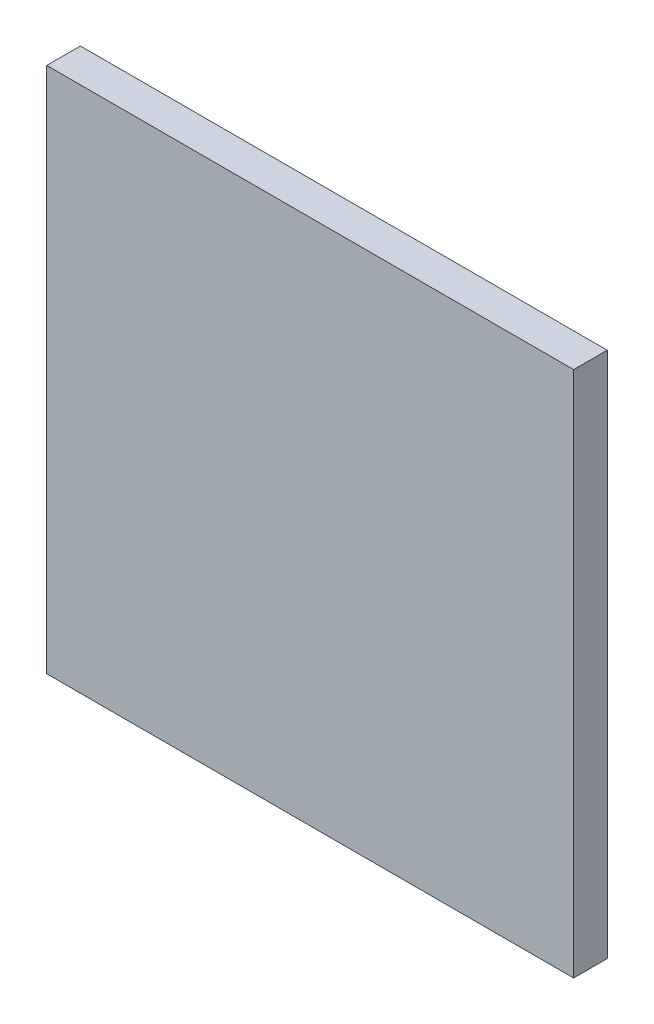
ISO-10303-21;
HEADER;
FILE_DESCRIPTION(('STEP AP214'),'2;1');
FILE_NAME('part.step','',(''),(''),'','','');
FILE_SCHEMA(('AUTOMOTIVE_DESIGN { 1 0 10303 214 1 1 1 1 }'));
ENDSEC;
DATA;
#1=APPLICATION_CONTEXT('core data for automotive mechanical design processes');
#2=APPLICATION_PROTOCOL_DEFINITION('international standard','automotive_design',2000,#1);
#3=PRODUCT_CONTEXT('',#1,'mechanical');
#4=PRODUCT('Part','Part','',(#3));
#5=PRODUCT_RELATED_PRODUCT_CATEGORY('part','',(#4));
#6=PRODUCT_DEFINITION_FORMATION('','',#4);
#7=PRODUCT_DEFINITION_CONTEXT('part definition',#1,'design');
#8=PRODUCT_DEFINITION('design','',#6,#7);
#9=PRODUCT_DEFINITION_SHAPE('','',#8);
#10=(LENGTH_UNIT() NAMED_UNIT(*) SI_UNIT(.MILLI.,.METRE.));
#11=(NAMED_UNIT(*) PLANE_ANGLE_UNIT() SI_UNIT($,.RADIAN.));
#12=(NAMED_UNIT(*) SI_UNIT($,.STERADIAN.) SOLID_ANGLE_UNIT());
#13=UNCERTAINTY_MEASURE_WITH_UNIT(LENGTH_MEASURE(1.E-05),#10,'distance_accuracy_value','');
#14=(GEOMETRIC_REPRESENTATION_CONTEXT(3) GLOBAL_UNCERTAINTY_ASSIGNED_CONTEXT((#13)) GLOBAL_UNIT_ASSIGNED_CONTEXT((#10,
#11,#12)) REPRESENTATION_CONTEXT('',''));
#15=CARTESIAN_POINT('',(0.,0.,0.));
#16=DIRECTION('',(0.,0.,1.));
#17=DIRECTION('',(1.,0.,0.));
#18=AXIS2_PLACEMENT_3D('',#15,#16,#17);
#19=CARTESIAN_POINT('',(23.5,23.5,3.));
#20=DIRECTION('',(-1.,0.,0.));
#21=DIRECTION('',(0.,-1.,0.));
#22=AXIS2_PLACEMENT_3D('',#19,#20,#21);
#23=PLANE('',#22);
#24=DIRECTION('',(0.,1.,0.));
#25=VECTOR('',#24,1.);
#26=CARTESIAN_POINT('',(23.5,23.5,0.));
#27=LINE('',#26,#25);
#28=CARTESIAN_POINT('',(23.5,-23.5,0.));
#29=VERTEX_POINT('',#28);
#30=CARTESIAN_POINT('',(23.5,23.5,0.));
#31=VERTEX_POINT('',#30);
#32=EDGE_CURVE('E96',#29,#31,#27,.T.);
#33=ORIENTED_EDGE('',*,*,#32,.T.);
#34=DIRECTION('',(0.,0.,-1.));
#35=VECTOR('',#34,1.);
#36=CARTESIAN_POINT('',(23.5,23.5,3.));
#37=LINE('',#36,#35);
#38=CARTESIAN_POINT('',(23.5,23.5,3.));
#39=VERTEX_POINT('',#38);
#40=EDGE_CURVE('E11',#39,#31,#37,.T.);
#41=ORIENTED_EDGE('',*,*,#40,.F.);
#42=DIRECTION('',(0.,1.,0.));
#43=VECTOR('',#42,1.);
#44=CARTESIAN_POINT('',(23.5,23.5,3.));
#45=LINE('',#44,#43);
#46=CARTESIAN_POINT('',(23.5,-23.5,3.));
#47=VERTEX_POINT('',#46);
#48=EDGE_CURVE('E84',#47,#39,#45,.T.);
#49=ORIENTED_EDGE('',*,*,#48,.F.);
#50=DIRECTION('',(0.,0.,-1.));
#51=VECTOR('',#50,1.);
#52=CARTESIAN_POINT('',(23.5,-23.5,3.));
#53=LINE('',#52,#51);
#54=EDGE_CURVE('E92',#47,#29,#53,.T.);
#55=ORIENTED_EDGE('',*,*,#54,.T.);
#56=EDGE_LOOP('',(#33,#41,#49,#55));
#57=FACE_BOUND('',#56,.T.);
#58=ADVANCED_FACE('F33',(#57),#23,.F.);
#59=CARTESIAN_POINT('',(-23.5,23.5,3.));
#60=DIRECTION('',(0.,-1.,0.));
#61=DIRECTION('',(0.,0.,-1.));
#62=AXIS2_PLACEMENT_3D('',#59,#60,#61);
#63=PLANE('',#62);
#64=DIRECTION('',(-1.,0.,0.));
#65=VECTOR('',#64,1.);
#66=CARTESIAN_POINT('',(-23.5,23.5,0.));
#67=LINE('',#66,#65);
#68=CARTESIAN_POINT('',(-23.5,23.5,0.));
#69=VERTEX_POINT('',#68);
#70=EDGE_CURVE('E88',#31,#69,#67,.T.);
#71=ORIENTED_EDGE('',*,*,#70,.T.);
#72=DIRECTION('',(0.,0.,-1.));
#73=VECTOR('',#72,1.);
#74=CARTESIAN_POINT('',(-23.5,23.5,3.));
#75=LINE('',#74,#73);
#76=CARTESIAN_POINT('',(-23.5,23.5,3.));
#77=VERTEX_POINT('',#76);
#78=EDGE_CURVE('E41',#77,#69,#75,.T.);
#79=ORIENTED_EDGE('',*,*,#78,.F.);
#80=DIRECTION('',(-1.,0.,0.));
#81=VECTOR('',#80,1.);
#82=CARTESIAN_POINT('',(-23.5,23.5,3.));
#83=LINE('',#82,#81);
#84=EDGE_CURVE('E79',#39,#77,#83,.T.);
#85=ORIENTED_EDGE('',*,*,#84,.F.);
#86=ORIENTED_EDGE('',*,*,#40,.T.);
#87=EDGE_LOOP('',(#71,#79,#85,#86));
#88=FACE_BOUND('',#87,.T.);
#89=ADVANCED_FACE('F87',(#88),#63,.F.);
#90=CARTESIAN_POINT('',(-23.5,23.5,3.));
#91=DIRECTION('',(1.,0.,0.));
#92=DIRECTION('',(0.,1.,0.));
#93=AXIS2_PLACEMENT_3D('',#90,#91,#92);
#94=PLANE('',#93);
#95=DIRECTION('',(0.,-1.,0.));
#96=VECTOR('',#95,1.);
#97=CARTESIAN_POINT('',(-23.5,23.5,0.));
#98=LINE('',#97,#96);
#99=CARTESIAN_POINT('',(-23.5,-23.5,0.));
#100=VERTEX_POINT('',#99);
#101=EDGE_CURVE('E66',#69,#100,#98,.T.);
#102=ORIENTED_EDGE('',*,*,#101,.T.);
#103=DIRECTION('',(0.,0.,-1.));
#104=VECTOR('',#103,1.);
#105=CARTESIAN_POINT('',(-23.5,-23.5,3.));
#106=LINE('',#105,#104);
#107=CARTESIAN_POINT('',(-23.5,-23.5,3.));
#108=VERTEX_POINT('',#107);
#109=EDGE_CURVE('E89',#108,#100,#106,.T.);
#110=ORIENTED_EDGE('',*,*,#109,.F.);
#111=DIRECTION('',(0.,-1.,0.));
#112=VECTOR('',#111,1.);
#113=CARTESIAN_POINT('',(-23.5,23.5,3.));
#114=LINE('',#113,#112);
#115=EDGE_CURVE('E82',#77,#108,#114,.T.);
#116=ORIENTED_EDGE('',*,*,#115,.F.);
#117=ORIENTED_EDGE('',*,*,#78,.T.);
#118=EDGE_LOOP('',(#102,#110,#116,#117));
#119=FACE_BOUND('',#118,.T.);
#120=ADVANCED_FACE('F90',(#119),#94,.F.);
#121=CARTESIAN_POINT('',(-23.5,-23.5,3.));
#122=DIRECTION('',(0.,1.,0.));
#123=DIRECTION('',(0.,0.,1.));
#124=AXIS2_PLACEMENT_3D('',#121,#122,#123);
#125=PLANE('',#124);
#126=DIRECTION('',(1.,0.,0.));
#127=VECTOR('',#126,1.);
#128=CARTESIAN_POINT('',(-23.5,-23.5,0.));
#129=LINE('',#128,#127);
#130=EDGE_CURVE('E72',#100,#29,#129,.T.);
#131=ORIENTED_EDGE('',*,*,#130,.T.);
#132=ORIENTED_EDGE('',*,*,#54,.F.);
#133=DIRECTION('',(1.,0.,0.));
#134=VECTOR('',#133,1.);
#135=CARTESIAN_POINT('',(-23.5,-23.5,3.));
#136=LINE('',#135,#134);
#137=EDGE_CURVE('E49',#108,#47,#136,.T.);
#138=ORIENTED_EDGE('',*,*,#137,.F.);
#139=ORIENTED_EDGE('',*,*,#109,.T.);
#140=EDGE_LOOP('',(#131,#132,#138,#139));
#141=FACE_BOUND('',#140,.T.);
#142=ADVANCED_FACE('F103',(#141),#125,.F.);
#143=CARTESIAN_POINT('',(0.,0.,3.));
#144=DIRECTION('',(0.,0.,1.));
#145=DIRECTION('',(1.,0.,0.));
#146=AXIS2_PLACEMENT_3D('',#143,#144,#145);
#147=PLANE('',#146);
#148=ORIENTED_EDGE('',*,*,#48,.T.);
#149=ORIENTED_EDGE('',*,*,#84,.T.);
#150=ORIENTED_EDGE('',*,*,#115,.T.);
#151=ORIENTED_EDGE('',*,*,#137,.T.);
#152=EDGE_LOOP('',(#148,#149,#150,#151));
#153=FACE_BOUND('',#152,.T.);
#154=ADVANCED_FACE('F80',(#153),#147,.T.);
#155=CARTESIAN_POINT('',(0.,0.,0.));
#156=DIRECTION('',(0.,0.,1.));
#157=DIRECTION('',(1.,0.,0.));
#158=AXIS2_PLACEMENT_3D('',#155,#156,#157);
#159=PLANE('',#158);
#160=ORIENTED_EDGE('',*,*,#32,.F.);
#161=ORIENTED_EDGE('',*,*,#130,.F.);
#162=ORIENTED_EDGE('',*,*,#101,.F.);
#163=ORIENTED_EDGE('',*,*,#70,.F.);
#164=EDGE_LOOP('',(#160,#161,#162,#163));
#165=FACE_BOUND('',#164,.T.);
#166=ADVANCED_FACE('F106',(#165),#159,.F.);
#167=CLOSED_SHELL('',(#58,#89,#120,#142,#154,#166));
#168=MANIFOLD_SOLID_BREP('B2',#167);
#169=ADVANCED_BREP_SHAPE_REPRESENTATION('',(#18,#168),#14);
#170=SHAPE_DEFINITION_REPRESENTATION(#9,#169);
ENDSEC;
END-ISO-10303-21;
